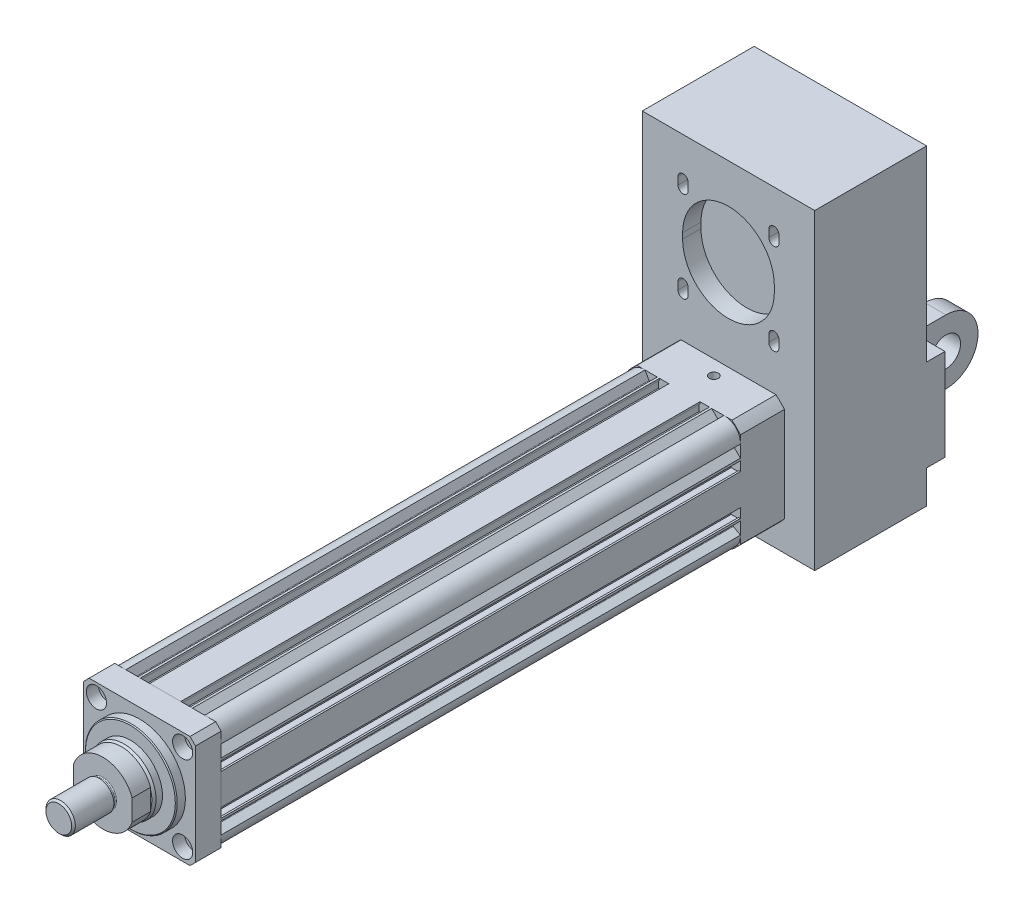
from build123d import *

# Parameters (mm, degrees)
SKETCH_1_R           = 25
SKETCH_1_R_2         = 2.594
EXTRUDE_1_DEPTH      = 283
EXTRUDE_1_2_DEPTH    = 14
SKETCH_3_R           = 4.5
SKETCH_3_R_2         = 3.5
CUT_EXTRUDE_3_DEPTH  = 14
SKETCH_3_5_R         = 5.5
CUT_EXTRUDE_4_DEPTH  = 6.5
SKETCH_5_R           = 25
EXTRUDE_2_DEPTH      = 5
CHAMFER_1_SIZE       = 0.5
SKETCH_6_R           = 17.5
EXTRUDE_3_DEPTH      = 5
CHAMFER_2_SIZE       = 1.5
CHAMFER_2_SIZE2      = 0.8
EXTRUDE_4_DEPTH      = 10
SKETCH_8_R           = 7
EXTRUDE_5_DEPTH      = 2
SKETCH_9_R           = 8
EXTRUDE_6_DEPTH      = 22
CHAMFER_3_SIZE       = 1
FILLET_1_R           = 0.5
SKETCH_10_W          = 61
SKETCH_10_H          = 61
EXTRUDE_7_DEPTH      = 24
SKETCH_11_R          = 50
SKETCH_11_R_2        = 40
CUT_EXTRUDE_1_DEPTH  = 24
SKETCH_26_W          = 94
SKETCH_26_H          = 170
EXTRUDE_11_DEPTH     = 61
CUT_EXTRUDE_11_DEPTH = 10
CUT_EXTRUDE_12_DEPTH = 10
CUT_EXTRUDE_START    = -10
CUT_EXTRUDE_13_DEPTH = 5
SKETCH_28_W          = 94
SKETCH_28_H          = 50
EXTRUDE_12_DEPTH     = 10
SKETCH_28_3_W        = 11.5
SKETCH_28_3_H        = 35
EXTRUDE_13_DEPTH     = 52.5
SKETCH_29_R          = 8
CUT_EXTRUDE_14_DEPTH = 52.5
CHAMFER_4_SIZE       = 2


with BuildPart() as part:
    # Sketch 1 → Extrude 1 (new body)
    with BuildSketch(Plane.XY):
        with BuildLine():
            Line((30.5, 8.5), (29.5, 8.5))
            Line((29.5, 8.5), (29.5, 7.9))
            Line((29.5, 7.9), (25.5, 7.9))
            Line((25.5, 7.9), (25.5, 14.2))
            Line((25.5, 14.2), (29.5, 14.2))
            Line((29.5, 14.2), (29.5, 13.6))
            Line((29.5, 13.6), (30.5, 13.6))
            Line((30.5, 13.6), (30.5, 14.843551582))
            Line((30.5, 14.843551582), (26.602512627, 18.741038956))
            ThreePointArc((26.602512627, 18.741038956), (26.502994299, 19.034210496), (26.675, 19.29163522))
            Line((26.675, 19.29163522), (30.5, 21.5))
            ThreePointArc((30.5, 21.5), (28.010599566, 28.010599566), (21.5, 30.5))
            Line((21.5, 30.5), (19.29163522, 26.675))
            ThreePointArc((19.29163522, 26.675), (19.034210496, 26.502994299), (18.741038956, 26.602512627))
            Line((18.741038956, 26.602512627), (14.843551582, 30.5))
            Line((14.843551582, 30.5), (13.6, 30.5))
            Line((13.6, 30.5), (13.6, 29.5))
            Line((13.6, 29.5), (14.2, 29.5))
            Line((14.2, 29.5), (14.2, 25.5))
            Line((14.2, 25.5), (7.9, 25.5))
            Line((7.9, 25.5), (7.9, 29.5))
            Line((7.9, 29.5), (8.5, 29.5))
            Line((8.5, 29.5), (8.5, 30.5))
            Line((8.5, 30.5), (-8.5, 30.5))
            Line((-8.5, 30.5), (-8.5, 29.5))
            Line((-8.5, 29.5), (-7.9, 29.5))
            Line((-7.9, 29.5), (-7.9, 25.5))
            Line((-7.9, 25.5), (-14.2, 25.5))
            Line((-14.2, 25.5), (-14.2, 29.5))
            Line((-14.2, 29.5), (-13.6, 29.5))
            Line((-13.6, 29.5), (-13.6, 30.5))
            Line((-13.6, 30.5), (-14.843551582, 30.5))
            Line((-14.843551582, 30.5), (-18.741038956, 26.602512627))
            ThreePointArc((-18.741038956, 26.602512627), (-19.034210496, 26.502994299), (-19.29163522, 26.675))
            Line((-19.29163522, 26.675), (-21.5, 30.5))
            ThreePointArc((-21.5, 30.5), (-28.010599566, 28.010599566), (-30.5, 21.5))
            Line((-30.5, 21.5), (-26.675, 19.29163522))
            ThreePointArc((-26.675, 19.29163522), (-26.502994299, 19.034210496), (-26.602512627, 18.741038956))
            Line((-26.602512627, 18.741038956), (-30.5, 14.843551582))
            Line((-30.5, 14.843551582), (-30.5, 13.6))
            Line((-30.5, 13.6), (-29.5, 13.6))
            Line((-29.5, 13.6), (-29.5, 14.2))
            Line((-29.5, 14.2), (-25.5, 14.2))
            Line((-25.5, 14.2), (-25.5, 7.9))
            Line((-25.5, 7.9), (-29.5, 7.9))
            Line((-29.5, 7.9), (-29.5, 8.5))
            Line((-29.5, 8.5), (-30.5, 8.5))
            Line((-30.5, 8.5), (-30.5, -8.5))
            Line((-30.5, -8.5), (-29.5, -8.5))
            Line((-29.5, -8.5), (-29.5, -7.9))
            Line((-29.5, -7.9), (-25.5, -7.9))
            Line((-25.5, -7.9), (-25.5, -14.2))
            Line((-25.5, -14.2), (-29.5, -14.2))
            Line((-29.5, -14.2), (-29.5, -13.6))
            Line((-29.5, -13.6), (-30.5, -13.6))
            Line((-30.5, -13.6), (-30.5, -14.843551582))
            Line((-30.5, -14.843551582), (-26.602512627, -18.741038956))
            ThreePointArc((-26.602512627, -18.741038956), (-26.502994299, -19.034210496), (-26.675, -19.29163522))
            Line((-26.675, -19.29163522), (-30.5, -21.5))
            ThreePointArc((-30.5, -21.5), (-27.825897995, -28.191225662), (-21, -30.5))
            Line((-21, -30.5), (-18.79163522, -26.675))
            ThreePointArc((-18.79163522, -26.675), (-18.534210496, -26.502994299), (-18.241038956, -26.602512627))
            Line((-18.241038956, -26.602512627), (-14.343551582, -30.5))
            Line((-14.343551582, -30.5), (14.343551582, -30.5))
            Line((14.343551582, -30.5), (18.241038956, -26.602512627))
            ThreePointArc((18.241038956, -26.602512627), (18.534210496, -26.502994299), (18.79163522, -26.675))
            Line((18.79163522, -26.675), (21, -30.5))
            ThreePointArc((21, -30.5), (27.825897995, -28.191225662), (30.5, -21.5))
            Line((30.5, -21.5), (26.675, -19.29163522))
            ThreePointArc((26.675, -19.29163522), (26.502994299, -19.034210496), (26.602512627, -18.741038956))
            Line((26.602512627, -18.741038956), (30.5, -14.843551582))
            Line((30.5, -14.843551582), (30.5, -13.6))
            Line((30.5, -13.6), (29.5, -13.6))
            Line((29.5, -13.6), (29.5, -14.2))
            Line((29.5, -14.2), (25.5, -14.2))
            Line((25.5, -14.2), (25.5, -7.9))
            Line((25.5, -7.9), (29.5, -7.9))
            Line((29.5, -7.9), (29.5, -8.5))
            Line((29.5, -8.5), (30.5, -8.5))
            Line((30.5, -8.5), (30.5, 8.5))
        make_face()
        Circle(SKETCH_1_R, mode=Mode.SUBTRACT)
        with Locations((23.5, -23.5)):
            Circle(SKETCH_1_R_2, mode=Mode.SUBTRACT)
        with Locations((-23.5, -23.5)):
            Circle(SKETCH_1_R_2, mode=Mode.SUBTRACT)
        with Locations((23.5, 23.5)):
            Circle(SKETCH_1_R_2, mode=Mode.SUBTRACT)
        with Locations((-23.5, 23.5)):
            Circle(SKETCH_1_R_2, mode=Mode.SUBTRACT)
        with BuildLine():
            Line((-14.843484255, -26.551505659), (-5.699422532, -26.551505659))
            ThreePointArc((-5.699422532, -26.551505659), (-5.401016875, -26.282393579), (-5.637974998, -25.957866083))
            ThreePointArc((-5.637974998, -25.957866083), (-10.496775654, -24.470016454), (-15.006657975, -22.128520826))
            ThreePointArc((-15.006657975, -22.128520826), (-15.31244973, -22.117932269), (-15.468484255, -22.381131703))
            Line((-15.468484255, -22.381131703), (-15.468484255, -25.926505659))
            Line((-15.468484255, -25.926505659), (-14.843484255, -26.551505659))
        make_face(mode=Mode.SUBTRACT)
        with BuildLine():
            Line((15.037740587, -26.551505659), (5.893678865, -26.551505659))
            ThreePointArc((5.893678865, -26.551505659), (5.595273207, -26.282393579), (5.832231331, -25.957866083))
            ThreePointArc((5.832231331, -25.957866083), (10.691031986, -24.470016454), (15.200914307, -22.128520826))
            ThreePointArc((15.200914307, -22.128520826), (15.506706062, -22.117932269), (15.662740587, -22.381131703))
            Line((15.662740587, -22.381131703), (15.662740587, -25.926505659))
            Line((15.662740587, -25.926505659), (15.037740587, -26.551505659))
        make_face(mode=Mode.SUBTRACT)
        with BuildLine():
            Line((24.057261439, -13.884764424), (23.358946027, -13.481591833))
            ThreePointArc((23.358946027, -13.481591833), (23.055418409, -13.441631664), (22.812535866, -13.628001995))
            Line((22.812535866, -13.628001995), (21.480305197, -15.935493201))
            ThreePointArc((21.480305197, -15.935493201), (21.440345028, -16.239020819), (21.626715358, -16.481903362))
            Line((21.626715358, -16.481903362), (22.892186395, -17.212523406))
            ThreePointArc((22.892186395, -17.212523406), (23.195714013, -17.252483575), (23.438596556, -17.066113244))
            Line((23.438596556, -17.066113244), (24.274264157, -15.618694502))
            ThreePointArc((24.274264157, -15.618694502), (24.317966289, -15.507082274), (24.326638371, -15.387533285))
            Line((24.326638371, -15.387533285), (24.223757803, -14.070923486))
            ThreePointArc((24.223757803, -14.070923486), (24.155411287, -13.964516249), (24.057261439, -13.884764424))
        make_face(mode=Mode.SUBTRACT)
        with BuildLine():
            Line((-24.057261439, -13.884764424), (-23.358946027, -13.481591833))
            ThreePointArc((-23.358946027, -13.481591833), (-23.055418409, -13.441631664), (-22.812535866, -13.628001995))
            Line((-22.812535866, -13.628001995), (-21.480305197, -15.935493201))
            ThreePointArc((-21.480305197, -15.935493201), (-21.440345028, -16.239020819), (-21.626715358, -16.481903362))
            Line((-21.626715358, -16.481903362), (-22.892186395, -17.212523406))
            ThreePointArc((-22.892186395, -17.212523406), (-23.195714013, -17.252483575), (-23.438596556, -17.066113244))
            Line((-23.438596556, -17.066113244), (-24.274264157, -15.618694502))
            ThreePointArc((-24.274264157, -15.618694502), (-24.317966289, -15.507082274), (-24.326638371, -15.387533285))
            Line((-24.326638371, -15.387533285), (-24.223757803, -14.070923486))
            ThreePointArc((-24.223757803, -14.070923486), (-24.155411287, -13.964516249), (-24.057261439, -13.884764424))
        make_face(mode=Mode.SUBTRACT)
        with BuildLine():
            Line((24.057261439, 13.884764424), (23.358946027, 13.481591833))
            ThreePointArc((23.358946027, 13.481591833), (23.055418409, 13.441631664), (22.812535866, 13.628001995))
            Line((22.812535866, 13.628001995), (21.480305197, 15.935493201))
            ThreePointArc((21.480305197, 15.935493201), (21.440345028, 16.239020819), (21.626715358, 16.481903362))
            Line((21.626715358, 16.481903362), (22.892186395, 17.212523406))
            ThreePointArc((22.892186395, 17.212523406), (23.195714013, 17.252483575), (23.438596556, 17.066113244))
            Line((23.438596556, 17.066113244), (24.274264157, 15.618694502))
            ThreePointArc((24.274264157, 15.618694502), (24.317966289, 15.507082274), (24.326638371, 15.387533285))
            Line((24.326638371, 15.387533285), (24.223757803, 14.070923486))
            ThreePointArc((24.223757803, 14.070923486), (24.155411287, 13.964516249), (24.057261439, 13.884764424))
        make_face(mode=Mode.SUBTRACT)
        with BuildLine():
            Line((-24.057261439, 13.884764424), (-23.358946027, 13.481591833))
            ThreePointArc((-23.358946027, 13.481591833), (-23.055418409, 13.441631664), (-22.812535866, 13.628001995))
            Line((-22.812535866, 13.628001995), (-21.480305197, 15.935493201))
            ThreePointArc((-21.480305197, 15.935493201), (-21.440345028, 16.239020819), (-21.626715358, 16.481903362))
            Line((-21.626715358, 16.481903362), (-22.892186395, 17.212523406))
            ThreePointArc((-22.892186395, 17.212523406), (-23.195714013, 17.252483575), (-23.438596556, 17.066113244))
            Line((-23.438596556, 17.066113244), (-24.274264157, 15.618694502))
            ThreePointArc((-24.274264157, 15.618694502), (-24.317966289, 15.507082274), (-24.326638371, 15.387533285))
            Line((-24.326638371, 15.387533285), (-24.223757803, 14.070923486))
            ThreePointArc((-24.223757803, 14.070923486), (-24.155411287, 13.964516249), (-24.057261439, 13.884764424))
        make_face(mode=Mode.SUBTRACT)
        with BuildLine():
            Line((17.761634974, 23.75411276), (17.07315308, 24.68624059))
            ThreePointArc((17.07315308, 24.68624059), (16.934629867, 24.812286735), (16.758415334, 24.87572765))
            Line((16.758415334, 24.87572765), (13.966108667, 25.295529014))
            ThreePointArc((13.966108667, 25.295529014), (13.689318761, 25.25468305), (13.482325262, 25.066441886))
            Line((13.482325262, 25.066441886), (12.839111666, 23.986237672))
            ThreePointArc((12.839111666, 23.986237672), (12.785382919, 23.626185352), (12.999780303, 23.331977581))
            ThreePointArc((12.999780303, 23.331977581), (14.833000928, 22.112125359), (16.576342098, 20.766949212))
            ThreePointArc((16.576342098, 20.766949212), (17.053890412, 20.688035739), (17.357364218, 21.065107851))
            Line((17.357364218, 21.065107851), (17.761634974, 23.75411276))
        make_face(mode=Mode.SUBTRACT)
        with BuildLine():
            Line((-17.761634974, 23.75411276), (-17.07315308, 24.68624059))
            ThreePointArc((-17.07315308, 24.68624059), (-16.934629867, 24.812286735), (-16.758415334, 24.87572765))
            Line((-16.758415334, 24.87572765), (-13.966108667, 25.295529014))
            ThreePointArc((-13.966108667, 25.295529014), (-13.689318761, 25.25468305), (-13.482325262, 25.066441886))
            Line((-13.482325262, 25.066441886), (-12.839111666, 23.986237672))
            ThreePointArc((-12.839111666, 23.986237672), (-12.785382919, 23.626185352), (-12.999780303, 23.331977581))
            ThreePointArc((-12.999780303, 23.331977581), (-14.833000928, 22.112125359), (-16.576342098, 20.766949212))
            ThreePointArc((-16.576342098, 20.766949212), (-17.053890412, 20.688035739), (-17.357364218, 21.065107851))
            Line((-17.357364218, 21.065107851), (-17.761634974, 23.75411276))
        make_face(mode=Mode.SUBTRACT)
    extrude(amount=EXTRUDE_1_DEPTH)

    # Sketch 10 → Extrude 7 (add)
    with BuildSketch(Plane(origin=(0, 0, 0), x_dir=(-1, 0, 0), z_dir=(0, 0, -1))):
        Rectangle(SKETCH_10_W, SKETCH_10_H)
    extrude(amount=EXTRUDE_7_DEPTH)

    # Sketch 11 → Cut-Extrude 1 (cut)
    with BuildSketch(Plane(origin=(0, 0, -24), x_dir=(-1, 0, 0), z_dir=(0, 0, -1))):
        Circle(SKETCH_11_R)
        Circle(SKETCH_11_R_2, mode=Mode.SUBTRACT)
    extrude(amount=-CUT_EXTRUDE_1_DEPTH, mode=Mode.SUBTRACT)

    # Sketch 15 → Hole Wizard M6 _1 (revolve, cut)
    with BuildSketch(Plane(origin=(0, 30.5, -16), x_dir=(0, 0, 1), z_dir=(1, 0, 0))):
        Polygon((0, 0), (0, 9.502151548), (2.5, 8), (2.5, 0), align=None)
    revolve(axis=Axis((0, 36.85, -16), (0, -1, 0)), mode=Mode.SUBTRACT)

    # Sketch 26 → Extrude 11 (add)
    with BuildSketch(Plane(origin=(0, 0, -24), x_dir=(-1, 0, 0), z_dir=(0, 0, -1))):
        with Locations((0, 43)):
            Rectangle(SKETCH_26_W, SKETCH_26_H)
    extrude(amount=EXTRUDE_11_DEPTH)

    # Sketch 27 → Cut-Extrude 11 (cut)
    with BuildSketch(Plane.XY.offset(-24)):
        with BuildLine():
            Line((-25, 81.5), (-24.999999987, 78.49920032))
            ThreePointArc((-24.999999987, 78.49920032), (0.00039984, 53.500000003), (25, 78.5))
            Line((25, 78.5), (25, 81.5))
            ThreePointArc((25, 81.5), (0, 106.5), (-25, 81.5))
        make_face()
    extrude(amount=-CUT_EXTRUDE_11_DEPTH, mode=Mode.SUBTRACT)

    # Sketch 27_3 → Cut-Extrude 12 (cut)
    with BuildSketch(Plane.XY.offset(-24)):
        with BuildLine():
            Line((-27.498737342, 102.748737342), (-27.498737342, 106.748737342))
            ThreePointArc((-27.498737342, 106.748737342), (-24.748737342, 109.498737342), (-21.998737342, 106.748737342))
            Line((-21.998737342, 106.748737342), (-21.998737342, 102.748737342))
            ThreePointArc((-21.998737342, 102.748737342), (-24.748737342, 99.998737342), (-27.498737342, 102.748737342))
        make_face()
        with BuildLine():
            Line((27.498737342, 102.748737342), (27.498737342, 106.748737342))
            ThreePointArc((27.498737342, 106.748737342), (24.748737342, 109.498737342), (21.998737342, 106.748737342))
            Line((21.998737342, 106.748737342), (21.998737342, 102.748737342))
            ThreePointArc((21.998737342, 102.748737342), (24.748737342, 99.998737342), (27.498737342, 102.748737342))
        make_face()
        with BuildLine():
            Line((27.498737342, 57.251262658), (27.498737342, 53.251262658))
            ThreePointArc((27.498737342, 53.251262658), (24.748737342, 50.501262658), (21.998737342, 53.251262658))
            Line((21.998737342, 53.251262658), (21.998737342, 57.251262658))
            ThreePointArc((21.998737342, 57.251262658), (24.748737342, 60.001262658), (27.498737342, 57.251262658))
        make_face()
        with BuildLine():
            Line((-27.498737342, 57.251262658), (-27.498737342, 53.251262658))
            ThreePointArc((-27.498737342, 53.251262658), (-24.748737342, 50.501262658), (-21.998737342, 53.251262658))
            Line((-21.998737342, 53.251262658), (-21.998737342, 57.251262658))
            ThreePointArc((-21.998737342, 57.251262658), (-24.748737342, 60.001262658), (-27.498737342, 57.251262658))
        make_face()
    extrude(amount=-CUT_EXTRUDE_12_DEPTH, mode=Mode.SUBTRACT)

    # Sketch 27_4 → Cut-Extrude 13 (cut)
    with BuildSketch(Plane.XY.offset(-24).offset(CUT_EXTRUDE_START)):
        with BuildLine():
            Line((-28.848737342, 101.848737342), (-28.848737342, 107.648737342))
            ThreePointArc((-28.848737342, 107.648737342), (-24.748737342, 111.748737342), (-20.648737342, 107.648737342))
            Line((-20.648737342, 107.648737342), (-20.648737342, 101.848737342))
            ThreePointArc((-20.648737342, 101.848737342), (-24.748737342, 97.748737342), (-28.848737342, 101.848737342))
        make_face()
        with BuildLine():
            Line((28.848737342, 101.848737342), (28.848737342, 107.648737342))
            ThreePointArc((28.848737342, 107.648737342), (24.748737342, 111.748737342), (20.648737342, 107.648737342))
            Line((20.648737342, 107.648737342), (20.648737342, 101.848737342))
            ThreePointArc((20.648737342, 101.848737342), (24.748737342, 97.748737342), (28.848737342, 101.848737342))
        make_face()
        with BuildLine():
            Line((28.848737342, 58.151262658), (28.848737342, 52.351262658))
            ThreePointArc((28.848737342, 52.351262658), (24.748737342, 48.251262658), (20.648737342, 52.351262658))
            Line((20.648737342, 52.351262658), (20.648737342, 58.151262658))
            ThreePointArc((20.648737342, 58.151262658), (24.748737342, 62.251262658), (28.848737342, 58.151262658))
        make_face()
        with BuildLine():
            Line((-28.848737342, 58.151262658), (-28.848737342, 52.351262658))
            ThreePointArc((-28.848737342, 52.351262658), (-24.748737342, 48.251262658), (-20.648737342, 52.351262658))
            Line((-20.648737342, 52.351262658), (-20.648737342, 58.151262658))
            ThreePointArc((-20.648737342, 58.151262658), (-24.748737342, 62.251262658), (-28.848737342, 58.151262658))
        make_face()
    extrude(amount=-CUT_EXTRUDE_13_DEPTH, mode=Mode.SUBTRACT)



with BuildPart() as body_2:
    # Sketch 2 → Extrude 1 2 (new body)
    with BuildSketch(Plane.XY.offset(283)):
        Polygon((-27.5, 30.5), (-30.5, 27.5), (-30.5, -27.5), (-27.5, -30.5), (27.5, -30.5), (30.5, -27.5), (30.5, 27.5), (27.5, 30.5), align=None)
    extrude(amount=EXTRUDE_1_2_DEPTH)

    # Sketch 3 → Cut-Extrude 3 (cut)
    with BuildSketch(Plane.XY.offset(297)):
        with Locations((-40, -20)):
            Circle(SKETCH_3_R)
        with Locations((-23.5, -23.5)):
            Circle(SKETCH_3_R_2)
        with Locations((-23.5, 23.5)):
            Circle(SKETCH_3_R_2)
        with Locations((23.5, 23.5)):
            Circle(SKETCH_3_R_2)
        with Locations((40, 20)):
            Circle(SKETCH_3_R)
        with Locations((40, -20)):
            Circle(SKETCH_3_R)
        with Locations((23.5, -23.5)):
            Circle(SKETCH_3_R_2)
        with Locations((-40, 20)):
            Circle(SKETCH_3_R)
    extrude(amount=-CUT_EXTRUDE_3_DEPTH, mode=Mode.SUBTRACT)

    # Sketch 3_5 → Cut-Extrude 4 (cut)
    with BuildSketch(Plane.XY.offset(297)):
        with Locations((-23.5, 23.5)):
            Circle(SKETCH_3_5_R)
        with Locations((-23.5, -23.5)):
            Circle(SKETCH_3_5_R)
        with Locations((23.5, -23.5)):
            Circle(SKETCH_3_5_R)
        with Locations((23.5, 23.5)):
            Circle(SKETCH_3_5_R)
    extrude(amount=-CUT_EXTRUDE_4_DEPTH, mode=Mode.SUBTRACT)

    # Sketch 5 → Extrude 2 (add)
    with BuildSketch(Plane.XY.offset(297)):
        Circle(SKETCH_5_R)
    extrude(amount=EXTRUDE_2_DEPTH)

    # Chamfer 1
    chamfer_1_edges = [body_2.edges().sort_by_distance(p)[0] for p in [
        (-25, 0, 302),
    ]]
    chamfer(chamfer_1_edges, length=CHAMFER_1_SIZE)

    # Sketch 6 → Extrude 3 (add)
    with BuildSketch(Plane.XY.offset(302)):
        Circle(SKETCH_6_R)
    extrude(amount=EXTRUDE_3_DEPTH)

    # Chamfer 2
    chamfer_2_edges = [body_2.edges().sort_by_distance(p)[0] for p in [
        (-17.5, 0, 307),
    ]]
    chamfer_2_side = [body_2.faces().sort_by_distance(p)[0] for p in [
        (-17.5, 0, 304.5),
    ]]
    chamfer(chamfer_2_edges, length=CHAMFER_2_SIZE, length2=CHAMFER_2_SIZE2, reference=chamfer_2_side[0])

    # Sketch 7 → Extrude 4 (add)
    with BuildSketch(Plane.XY.offset(307)):
        with BuildLine():
            Line((-16, 5.744562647), (-16, -5.744562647))
            ThreePointArc((-16, -5.744562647), (0, -17), (16, -5.744562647))
            Line((16, -5.744562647), (16, 5.744562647))
            ThreePointArc((16, 5.744562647), (0, 17), (-16, 5.744562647))
        make_face()
    extrude(amount=EXTRUDE_4_DEPTH)

    # Sketch 8 → Extrude 5 (add)
    with BuildSketch(Plane.XY.offset(317)):
        Circle(SKETCH_8_R)
    extrude(amount=EXTRUDE_5_DEPTH)

    # Sketch 9 → Extrude 6 (add)
    with BuildSketch(Plane.XY.offset(319)):
        Circle(SKETCH_9_R)
    extrude(amount=EXTRUDE_6_DEPTH)

    # Chamfer 3
    chamfer_3_edges = [body_2.edges().sort_by_distance(p)[0] for p in [
        (-8, 0, 341),
    ]]
    chamfer(chamfer_3_edges, length=CHAMFER_3_SIZE)

    # Fillet 1
    fillet_1_edges = [body_2.edges().sort_by_distance(p)[0] for p in [
        (-7, 0, 317),
    ]]
    fillet(fillet_1_edges, radius=FILLET_1_R)


with BuildPart() as body_3:
    # Sketch 28 → Extrude 12 (new body)
    with BuildSketch(Plane(origin=(0, 0, -85), x_dir=(-1, 0, 0), z_dir=(0, 0, -1))):
        with Locations((0, 1)):
            Rectangle(SKETCH_28_W, SKETCH_28_H)
    extrude(amount=EXTRUDE_12_DEPTH)


with BuildPart() as part_1:
    add(part.part)

    add(body_3.part)  # Extrude 13 merges body 3
    # Sketch 28_3 → Extrude 13 (add)
    with BuildSketch(Plane(origin=(0, 0, -85), x_dir=(-1, 0, 0), z_dir=(0, 0, -1))):
        with Locations((-16.75, 1)):
            Rectangle(SKETCH_28_3_W, SKETCH_28_3_H)
        with Locations((16.75, 1)):
            Rectangle(SKETCH_28_3_W, SKETCH_28_3_H)
    extrude(amount=EXTRUDE_13_DEPTH)

    # Sketch 29 → Cut-Extrude 14 (cut)
    with BuildSketch(Plane.ZY.offset(22.5)):
        with Locations((-120, 1)):
            Circle(SKETCH_29_R)
        with BuildLine():
            Line((-120, 18.5), (-161.57380584, 27.053304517))
            Line((-161.57380584, 27.053304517), (-176.509286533, -24.342191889))
            Line((-176.509286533, -24.342191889), (-125.051760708, -41.168065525))
            Line((-125.051760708, -41.168065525), (-120, -16.5))
            ThreePointArc((-120, -16.5), (-137.5, 1), (-120, 18.5))
        make_face()
    extrude(amount=-CUT_EXTRUDE_14_DEPTH, mode=Mode.SUBTRACT)

    # Chamfer 4
    chamfer_4_edges = [part_1.edges().sort_by_distance(p)[0] for p in [
        (16.75, 18.5, -95),
        (11, 1, -95),
        (22.5, 1, -95),
        (16.75, -16.5, -95),
        (-16.75, 18.5, -95),
        (-22.5, 1, -95),
        (-16.75, -16.5, -95),
        (-11, 1, -95),
    ]]
    chamfer(chamfer_4_edges, length=CHAMFER_4_SIZE)


solid = Compound([body_2.part, part_1.part])
